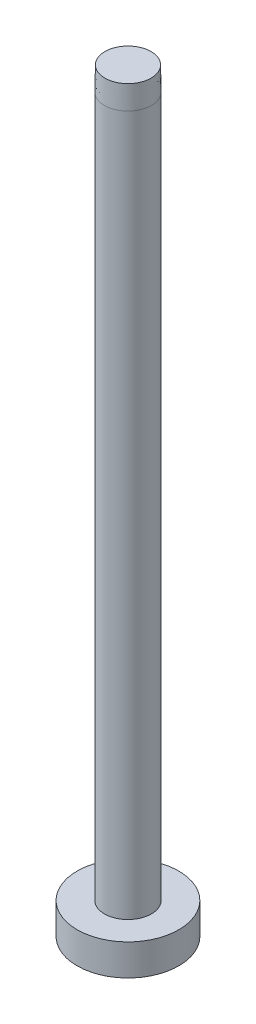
ISO-10303-21;
HEADER;
FILE_DESCRIPTION(('STEP AP214'),'2;1');
FILE_NAME('part.step','',(''),(''),'','','');
FILE_SCHEMA(('AUTOMOTIVE_DESIGN { 1 0 10303 214 1 1 1 1 }'));
ENDSEC;
DATA;
#1=APPLICATION_CONTEXT('core data for automotive mechanical design processes');
#2=APPLICATION_PROTOCOL_DEFINITION('international standard','automotive_design',2000,#1);
#3=PRODUCT_CONTEXT('',#1,'mechanical');
#4=PRODUCT('Part','Part','',(#3));
#5=PRODUCT_RELATED_PRODUCT_CATEGORY('part','',(#4));
#6=PRODUCT_DEFINITION_FORMATION('','',#4);
#7=PRODUCT_DEFINITION_CONTEXT('part definition',#1,'design');
#8=PRODUCT_DEFINITION('design','',#6,#7);
#9=PRODUCT_DEFINITION_SHAPE('','',#8);
#10=(LENGTH_UNIT() NAMED_UNIT(*) SI_UNIT(.MILLI.,.METRE.));
#11=(NAMED_UNIT(*) PLANE_ANGLE_UNIT() SI_UNIT($,.RADIAN.));
#12=(NAMED_UNIT(*) SI_UNIT($,.STERADIAN.) SOLID_ANGLE_UNIT());
#13=UNCERTAINTY_MEASURE_WITH_UNIT(LENGTH_MEASURE(1.E-05),#10,'distance_accuracy_value','');
#14=(GEOMETRIC_REPRESENTATION_CONTEXT(3) GLOBAL_UNCERTAINTY_ASSIGNED_CONTEXT((#13)) GLOBAL_UNIT_ASSIGNED_CONTEXT((#10,
#11,#12)) REPRESENTATION_CONTEXT('',''));
#15=CARTESIAN_POINT('',(0.,0.,0.));
#16=DIRECTION('',(0.,0.,1.));
#17=DIRECTION('',(1.,0.,0.));
#18=AXIS2_PLACEMENT_3D('',#15,#16,#17);
#19=CARTESIAN_POINT('',(-2.94763480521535,96.5,0.));
#20=DIRECTION('',(0.,1.,0.));
#21=DIRECTION('',(0.,0.,1.));
#22=AXIS2_PLACEMENT_3D('',#19,#20,#21);
#23=PLANE('',#22);
#24=CARTESIAN_POINT('',(0.,96.5,0.));
#25=DIRECTION('',(0.,1.,0.));
#26=DIRECTION('',(0.,0.,1.));
#27=AXIS2_PLACEMENT_3D('',#24,#25,#26);
#28=CIRCLE('',#27,2.94763480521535);
#29=CARTESIAN_POINT('',(0.,96.5,2.94763480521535));
#30=VERTEX_POINT('',#29);
#31=EDGE_CURVE('E10',#30,#30,#28,.T.);
#32=ORIENTED_EDGE('',*,*,#31,.T.);
#33=EDGE_LOOP('',(#32));
#34=FACE_BOUND('',#33,.T.);
#35=ADVANCED_FACE('F31',(#34),#23,.T.);
#36=CARTESIAN_POINT('',(0.,96.5,0.));
#37=DIRECTION('',(0.,-1.,0.));
#38=DIRECTION('',(0.,0.,-1.));
#39=AXIS2_PLACEMENT_3D('',#36,#37,#38);
#40=CONICAL_SURFACE('',#39,2.94763480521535,0.0174532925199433);
#41=CARTESIAN_POINT('',(0.,93.5000000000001,0.));
#42=DIRECTION('',(0.,1.,0.));
#43=DIRECTION('',(0.,0.,1.));
#44=AXIS2_PLACEMENT_3D('',#41,#42,#43);
#45=CIRCLE('',#44,3.);
#46=CARTESIAN_POINT('',(0.,93.5000000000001,3.));
#47=VERTEX_POINT('',#46);
#48=EDGE_CURVE('E37',#47,#47,#45,.T.);
#49=ORIENTED_EDGE('',*,*,#48,.T.);
#50=EDGE_LOOP('',(#49));
#51=FACE_BOUND('',#50,.T.);
#52=ORIENTED_EDGE('',*,*,#31,.F.);
#53=EDGE_LOOP('',(#52));
#54=FACE_BOUND('',#53,.T.);
#55=ADVANCED_FACE('F66',(#51,#54),#40,.T.);
#56=CARTESIAN_POINT('',(0.,49.4323076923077,0.));
#57=DIRECTION('',(0.,1.,0.));
#58=DIRECTION('',(0.,0.,1.));
#59=AXIS2_PLACEMENT_3D('',#56,#57,#58);
#60=CYLINDRICAL_SURFACE('',#59,3.);
#61=CARTESIAN_POINT('',(0.,4.,0.));
#62=DIRECTION('',(0.,1.,0.));
#63=DIRECTION('',(0.,0.,1.));
#64=AXIS2_PLACEMENT_3D('',#61,#62,#63);
#65=CIRCLE('',#64,3.);
#66=CARTESIAN_POINT('',(0.,4.,3.));
#67=VERTEX_POINT('',#66);
#68=EDGE_CURVE('E41',#67,#67,#65,.T.);
#69=ORIENTED_EDGE('',*,*,#68,.T.);
#70=EDGE_LOOP('',(#69));
#71=FACE_BOUND('',#70,.T.);
#72=ORIENTED_EDGE('',*,*,#48,.F.);
#73=EDGE_LOOP('',(#72));
#74=FACE_BOUND('',#73,.T.);
#75=ADVANCED_FACE('F70',(#71,#74),#60,.T.);
#76=CARTESIAN_POINT('',(-6.49999999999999,4.,0.));
#77=DIRECTION('',(0.,1.,0.));
#78=DIRECTION('',(0.,0.,1.));
#79=AXIS2_PLACEMENT_3D('',#76,#77,#78);
#80=PLANE('',#79);
#81=CARTESIAN_POINT('',(0.,4.,0.));
#82=DIRECTION('',(0.,1.,0.));
#83=DIRECTION('',(0.,0.,1.));
#84=AXIS2_PLACEMENT_3D('',#81,#82,#83);
#85=CIRCLE('',#84,6.49999999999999);
#86=CARTESIAN_POINT('',(0.,4.,6.49999999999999));
#87=VERTEX_POINT('',#86);
#88=EDGE_CURVE('E45',#87,#87,#85,.T.);
#89=ORIENTED_EDGE('',*,*,#88,.T.);
#90=EDGE_LOOP('',(#89));
#91=FACE_BOUND('',#90,.T.);
#92=ORIENTED_EDGE('',*,*,#68,.F.);
#93=EDGE_LOOP('',(#92));
#94=FACE_BOUND('',#93,.T.);
#95=ADVANCED_FACE('F63',(#91,#94),#80,.T.);
#96=CARTESIAN_POINT('',(0.,49.4323076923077,0.));
#97=DIRECTION('',(0.,1.,0.));
#98=DIRECTION('',(0.,0.,1.));
#99=AXIS2_PLACEMENT_3D('',#96,#97,#98);
#100=CYLINDRICAL_SURFACE('',#99,6.49999999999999);
#101=CARTESIAN_POINT('',(0.,0.,0.));
#102=DIRECTION('',(0.,1.,0.));
#103=DIRECTION('',(0.,0.,1.));
#104=AXIS2_PLACEMENT_3D('',#101,#102,#103);
#105=CIRCLE('',#104,6.49999999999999);
#106=CARTESIAN_POINT('',(0.,0.,6.49999999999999));
#107=VERTEX_POINT('',#106);
#108=EDGE_CURVE('E50',#107,#107,#105,.T.);
#109=ORIENTED_EDGE('',*,*,#108,.T.);
#110=EDGE_LOOP('',(#109));
#111=FACE_BOUND('',#110,.T.);
#112=ORIENTED_EDGE('',*,*,#88,.F.);
#113=EDGE_LOOP('',(#112));
#114=FACE_BOUND('',#113,.T.);
#115=ADVANCED_FACE('F54',(#111,#114),#100,.T.);
#116=CARTESIAN_POINT('',(0.,0.,0.));
#117=DIRECTION('',(0.,-1.,0.));
#118=DIRECTION('',(0.,0.,-1.));
#119=AXIS2_PLACEMENT_3D('',#116,#117,#118);
#120=PLANE('',#119);
#121=ORIENTED_EDGE('',*,*,#108,.F.);
#122=EDGE_LOOP('',(#121));
#123=FACE_BOUND('',#122,.T.);
#124=ADVANCED_FACE('F57',(#123),#120,.T.);
#125=CLOSED_SHELL('',(#35,#55,#75,#95,#115,#124));
#126=MANIFOLD_SOLID_BREP('B2',#125);
#127=ADVANCED_BREP_SHAPE_REPRESENTATION('',(#18,#126),#14);
#128=SHAPE_DEFINITION_REPRESENTATION(#9,#127);
ENDSEC;
END-ISO-10303-21;
